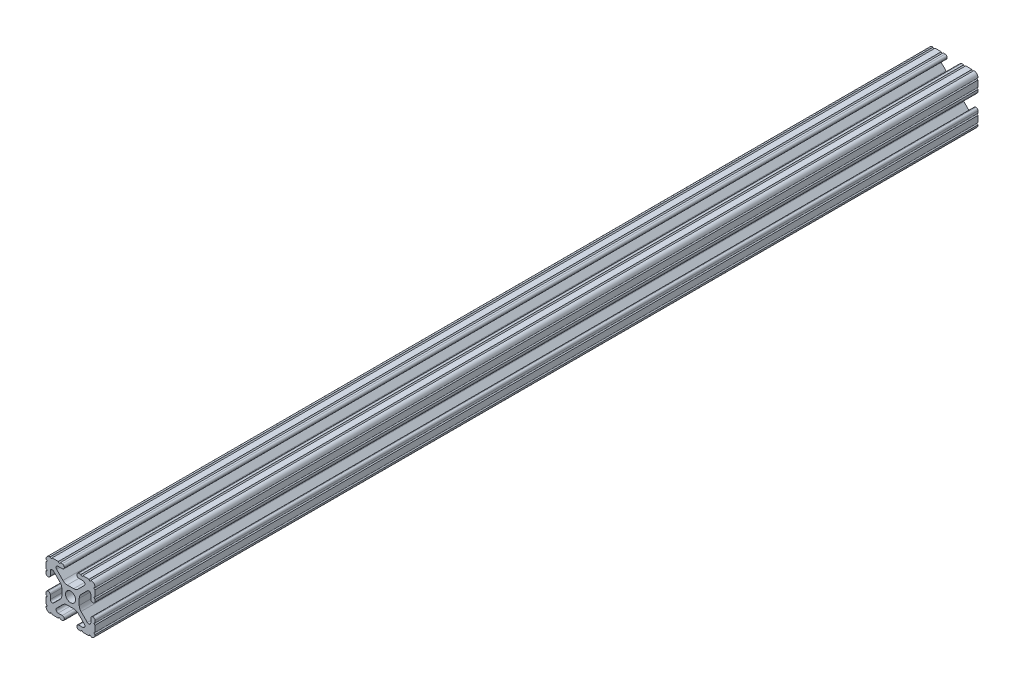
from build123d import *

# Parameters (mm, degrees)
SKETCH1_R      = 2.6035
EXTRUDE1_DEPTH = 457.2


with BuildPart() as part:
    # Sketch1 → Extrude1 (new body)
    with BuildSketch(Plane.XY):
        with BuildLine():
            Line((-7.207036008, 8.724370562), (-3.898272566, 5.423169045))
            ThreePointArc((-3.898272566, 5.423169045), (-2.869120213, 4.736787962), (-1.655778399, 4.4958))
            Line((-1.655778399, 4.4958), (1.655778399, 4.4958))
            ThreePointArc((1.655778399, 4.4958), (2.869120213, 4.736787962), (3.898272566, 5.423169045))
            Line((3.898272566, 5.423169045), (7.207036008, 8.724370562))
            ThreePointArc((7.207036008, 8.724370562), (7.432222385, 9.85140422), (6.476788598, 10.4902))
            Line((6.476788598, 10.4902), (4.287512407, 10.4902))
            ThreePointArc((4.287512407, 10.4902), (3.54574862, 10.79744862), (3.2385, 11.539212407))
            Line((3.2385, 11.539212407), (3.2385, 11.650987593))
            ThreePointArc((3.2385, 11.650987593), (3.54574862, 12.39275138), (4.287512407, 12.7))
            Line((4.287512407, 12.7), (5.317126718, 12.7))
            ThreePointArc((5.317126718, 12.7), (5.825126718, 12.192), (6.333126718, 12.7))
            Line((6.333126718, 12.7), (9.550443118, 12.7))
            ThreePointArc((9.550443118, 12.7), (10.058366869, 12.192000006), (10.566443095, 12.699847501))
            ThreePointArc((10.566443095, 12.699847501), (12.082537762, 12.08250727), (12.699846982, 10.566399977))
            ThreePointArc((12.699846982, 10.566399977), (12.192000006, 10.058323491), (12.7, 9.5504))
            Line((12.7, 9.5504), (12.7, 6.3330836))
            ThreePointArc((12.7, 6.3330836), (12.192, 5.8250836), (12.7, 5.3170836))
            Line((12.7, 5.3170836), (12.7, 4.287469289))
            ThreePointArc((12.7, 4.287469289), (12.39275138, 3.545705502), (11.650987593, 3.238456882))
            Line((11.650987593, 3.238456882), (11.539212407, 3.238456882))
            ThreePointArc((11.539212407, 3.238456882), (10.79744862, 3.545705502), (10.4902, 4.287469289))
            Line((10.4902, 4.287469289), (10.4902, 6.402089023))
            ThreePointArc((10.4902, 6.402089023), (9.856505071, 7.351067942), (8.737131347, 7.129408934))
            Line((8.737131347, 7.129408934), (5.441005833, 3.840816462))
            ThreePointArc((5.441005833, 3.840816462), (4.750877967, 2.809883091), (4.5085, 1.593185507))
            Line((4.5085, 1.593185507), (4.5085, -1.593185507))
            ThreePointArc((4.5085, -1.593185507), (4.750877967, -2.809883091), (5.441005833, -3.840816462))
            Line((5.441005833, -3.840816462), (8.737131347, -7.129408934))
            ThreePointArc((8.737131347, -7.129408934), (9.856505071, -7.351067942), (10.4902, -6.402089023))
            Line((10.4902, -6.402089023), (10.4902, -4.287469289))
            ThreePointArc((10.4902, -4.287469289), (10.79744862, -3.545705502), (11.539212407, -3.238456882))
            Line((11.539212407, -3.238456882), (11.650987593, -3.238456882))
            ThreePointArc((11.650987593, -3.238456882), (12.39275138, -3.545705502), (12.7, -4.287469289))
            Line((12.7, -4.287469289), (12.7, -5.3170836))
            ThreePointArc((12.7, -5.3170836), (12.192, -5.8250836), (12.7, -6.3330836))
            Line((12.7, -6.3330836), (12.7, -9.5504))
            ThreePointArc((12.7, -9.5504), (12.192000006, -10.058323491), (12.699846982, -10.566399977))
            ThreePointArc((12.699846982, -10.566399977), (12.082537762, -12.08250727), (10.566443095, -12.699847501))
            ThreePointArc((10.566443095, -12.699847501), (10.058366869, -12.192000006), (9.550443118, -12.7))
            Line((9.550443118, -12.7), (6.333126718, -12.7))
            ThreePointArc((6.333126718, -12.7), (5.825126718, -12.192), (5.317126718, -12.7))
            Line((5.317126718, -12.7), (4.287512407, -12.7))
            ThreePointArc((4.287512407, -12.7), (3.54574862, -12.39275138), (3.2385, -11.650987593))
            Line((3.2385, -11.650987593), (3.2385, -11.539212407))
            ThreePointArc((3.2385, -11.539212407), (3.54574862, -10.79744862), (4.287512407, -10.4902))
            Line((4.287512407, -10.4902), (6.416408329, -10.4902))
            ThreePointArc((6.416408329, -10.4902), (7.41473083, -9.822813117), (7.179650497, -8.645192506))
            Line((7.179650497, -8.645192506), (3.952270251, -5.423690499))
            ThreePointArc((3.952270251, -5.423690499), (2.922936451, -4.736929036), (1.709253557, -4.4958))
            Line((1.709253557, -4.4958), (-1.709253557, -4.4958))
            ThreePointArc((-1.709253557, -4.4958), (-2.922936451, -4.736929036), (-3.952270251, -5.423690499))
            Line((-3.952270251, -5.423690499), (-7.179650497, -8.645192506))
            ThreePointArc((-7.179650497, -8.645192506), (-7.41473083, -9.822813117), (-6.416408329, -10.4902))
            Line((-6.416408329, -10.4902), (-4.287512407, -10.4902))
            ThreePointArc((-4.287512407, -10.4902), (-3.54574862, -10.79744862), (-3.2385, -11.539212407))
            Line((-3.2385, -11.539212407), (-3.2385, -11.650987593))
            ThreePointArc((-3.2385, -11.650987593), (-3.54574862, -12.39275138), (-4.287512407, -12.7))
            Line((-4.287512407, -12.7), (-5.317126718, -12.7))
            ThreePointArc((-5.317126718, -12.7), (-5.825126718, -12.192), (-6.333126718, -12.7))
            Line((-6.333126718, -12.7), (-9.550443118, -12.7))
            ThreePointArc((-9.550443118, -12.7), (-10.058366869, -12.192000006), (-10.566443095, -12.699847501))
            ThreePointArc((-10.566443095, -12.699847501), (-12.082537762, -12.08250727), (-12.699846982, -10.566399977))
            ThreePointArc((-12.699846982, -10.566399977), (-12.192000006, -10.058323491), (-12.7, -9.5504))
            Line((-12.7, -9.5504), (-12.7, -6.3330836))
            ThreePointArc((-12.7, -6.3330836), (-12.192, -5.8250836), (-12.7, -5.3170836))
            Line((-12.7, -5.3170836), (-12.7, -4.287469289))
            ThreePointArc((-12.7, -4.287469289), (-12.39275138, -3.545705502), (-11.650987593, -3.238456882))
            Line((-11.650987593, -3.238456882), (-11.539212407, -3.238456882))
            ThreePointArc((-11.539212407, -3.238456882), (-10.79744862, -3.545705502), (-10.4902, -4.287469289))
            Line((-10.4902, -4.287469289), (-10.4902, -6.402089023))
            ThreePointArc((-10.4902, -6.402089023), (-9.856505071, -7.351067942), (-8.737131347, -7.129408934))
            Line((-8.737131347, -7.129408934), (-5.441005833, -3.840816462))
            ThreePointArc((-5.441005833, -3.840816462), (-4.750877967, -2.809883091), (-4.5085, -1.593185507))
            Line((-4.5085, -1.593185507), (-4.5085, 1.593185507))
            ThreePointArc((-4.5085, 1.593185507), (-4.750877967, 2.809883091), (-5.441005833, 3.840816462))
            Line((-5.441005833, 3.840816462), (-8.737131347, 7.129408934))
            ThreePointArc((-8.737131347, 7.129408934), (-9.856505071, 7.351067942), (-10.4902, 6.402089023))
            Line((-10.4902, 6.402089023), (-10.4902, 4.287469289))
            ThreePointArc((-10.4902, 4.287469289), (-10.79744862, 3.545705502), (-11.539212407, 3.238456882))
            Line((-11.539212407, 3.238456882), (-11.650987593, 3.238456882))
            ThreePointArc((-11.650987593, 3.238456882), (-12.39275138, 3.545705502), (-12.7, 4.287469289))
            Line((-12.7, 4.287469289), (-12.7, 5.3170836))
            ThreePointArc((-12.7, 5.3170836), (-12.192, 5.8250836), (-12.7, 6.3330836))
            Line((-12.7, 6.3330836), (-12.7, 9.5504))
            ThreePointArc((-12.7, 9.5504), (-12.192000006, 10.058323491), (-12.699846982, 10.566399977))
            ThreePointArc((-12.699846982, 10.566399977), (-12.082537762, 12.08250727), (-10.566443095, 12.699847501))
            ThreePointArc((-10.566443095, 12.699847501), (-10.058366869, 12.192000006), (-9.550443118, 12.7))
            Line((-9.550443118, 12.7), (-6.333126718, 12.7))
            ThreePointArc((-6.333126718, 12.7), (-5.825126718, 12.192), (-5.317126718, 12.7))
            Line((-5.317126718, 12.7), (-4.287512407, 12.7))
            ThreePointArc((-4.287512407, 12.7), (-3.54574862, 12.39275138), (-3.2385, 11.650987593))
            Line((-3.2385, 11.650987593), (-3.2385, 11.539212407))
            ThreePointArc((-3.2385, 11.539212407), (-3.54574862, 10.79744862), (-4.287512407, 10.4902))
            Line((-4.287512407, 10.4902), (-6.476788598, 10.4902))
            ThreePointArc((-6.476788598, 10.4902), (-7.432222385, 9.85140422), (-7.207036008, 8.724370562))
        make_face()
        Circle(SKETCH1_R, mode=Mode.SUBTRACT)
    extrude(amount=-EXTRUDE1_DEPTH)


solid = part.part
